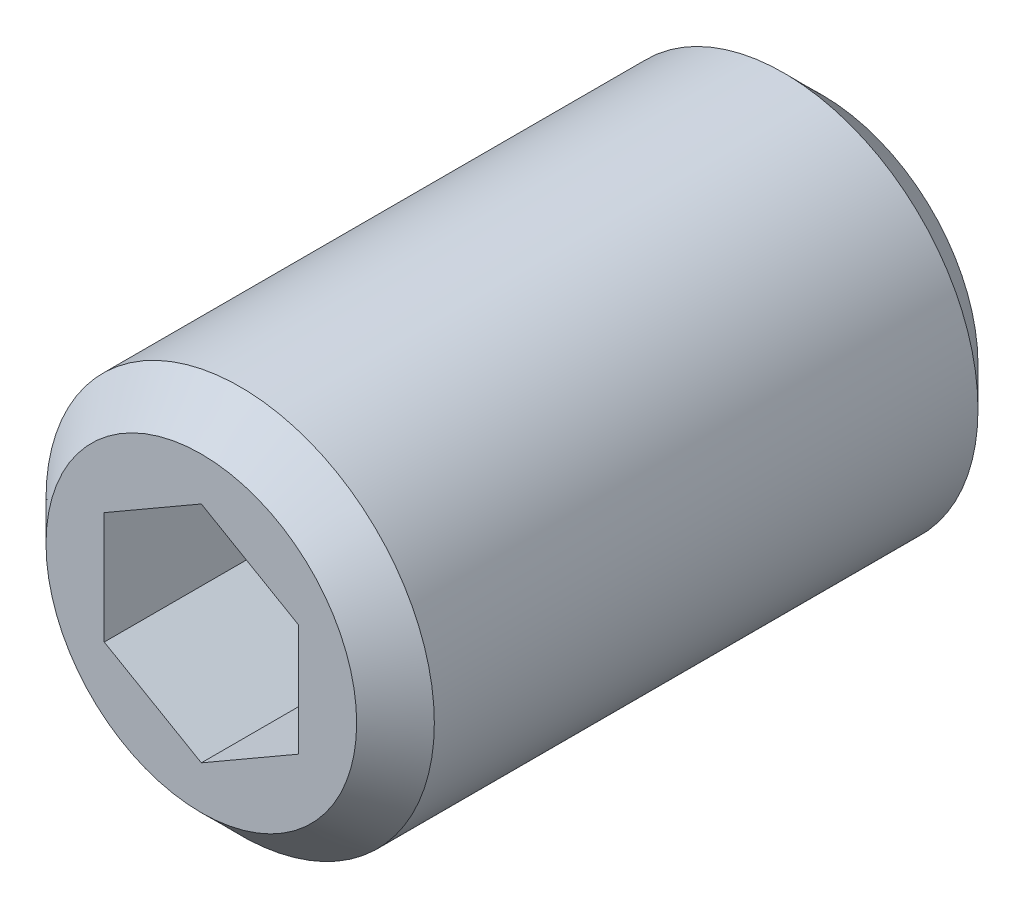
ISO-10303-21;
HEADER;
FILE_DESCRIPTION(('STEP AP214'),'2;1');
FILE_NAME('part.step','',(''),(''),'','','');
FILE_SCHEMA(('AUTOMOTIVE_DESIGN { 1 0 10303 214 1 1 1 1 }'));
ENDSEC;
DATA;
#1=APPLICATION_CONTEXT('core data for automotive mechanical design processes');
#2=APPLICATION_PROTOCOL_DEFINITION('international standard','automotive_design',2000,#1);
#3=PRODUCT_CONTEXT('',#1,'mechanical');
#4=PRODUCT('Part','Part','',(#3));
#5=PRODUCT_RELATED_PRODUCT_CATEGORY('part','',(#4));
#6=PRODUCT_DEFINITION_FORMATION('','',#4);
#7=PRODUCT_DEFINITION_CONTEXT('part definition',#1,'design');
#8=PRODUCT_DEFINITION('design','',#6,#7);
#9=PRODUCT_DEFINITION_SHAPE('','',#8);
#10=(LENGTH_UNIT() NAMED_UNIT(*) SI_UNIT(.MILLI.,.METRE.));
#11=(NAMED_UNIT(*) PLANE_ANGLE_UNIT() SI_UNIT($,.RADIAN.));
#12=(NAMED_UNIT(*) SI_UNIT($,.STERADIAN.) SOLID_ANGLE_UNIT());
#13=UNCERTAINTY_MEASURE_WITH_UNIT(LENGTH_MEASURE(1.E-05),#10,'distance_accuracy_value','');
#14=(GEOMETRIC_REPRESENTATION_CONTEXT(3) GLOBAL_UNCERTAINTY_ASSIGNED_CONTEXT((#13)) GLOBAL_UNIT_ASSIGNED_CONTEXT((#10,
#11,#12)) REPRESENTATION_CONTEXT('',''));
#15=CARTESIAN_POINT('',(0.,0.,0.));
#16=DIRECTION('',(0.,0.,1.));
#17=DIRECTION('',(1.,0.,0.));
#18=AXIS2_PLACEMENT_3D('',#15,#16,#17);
#19=CARTESIAN_POINT('',(0.,1.44337567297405,6.));
#20=DIRECTION('',(-0.5,-0.866025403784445,0.));
#21=DIRECTION('',(0.866025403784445,-0.5,0.));
#22=AXIS2_PLACEMENT_3D('',#19,#20,#21);
#23=PLANE('',#22);
#24=DIRECTION('',(0.,0.,1.));
#25=VECTOR('',#24,1.);
#26=CARTESIAN_POINT('',(1.25000000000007,0.721687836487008,6.));
#27=LINE('',#26,#25);
#28=CARTESIAN_POINT('',(1.25000000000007,0.721687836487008,6.));
#29=VERTEX_POINT('',#28);
#30=CARTESIAN_POINT('',(1.25000000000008,0.721687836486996,8.));
#31=VERTEX_POINT('',#30);
#32=EDGE_CURVE('E63',#29,#31,#27,.T.);
#33=ORIENTED_EDGE('',*,*,#32,.T.);
#34=DIRECTION('',(0.866025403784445,-0.5,0.));
#35=VECTOR('',#34,1.);
#36=CARTESIAN_POINT('',(0.,1.44337567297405,8.));
#37=LINE('',#36,#35);
#38=CARTESIAN_POINT('',(0.,1.44337567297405,8.));
#39=VERTEX_POINT('',#38);
#40=EDGE_CURVE('E29',#39,#31,#37,.T.);
#41=ORIENTED_EDGE('',*,*,#40,.F.);
#42=DIRECTION('',(0.,0.,1.));
#43=VECTOR('',#42,1.);
#44=CARTESIAN_POINT('',(0.,1.44337567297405,6.));
#45=LINE('',#44,#43);
#46=CARTESIAN_POINT('',(0.,1.44337567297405,6.));
#47=VERTEX_POINT('',#46);
#48=EDGE_CURVE('E33',#47,#39,#45,.T.);
#49=ORIENTED_EDGE('',*,*,#48,.F.);
#50=DIRECTION('',(0.866025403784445,-0.5,0.));
#51=VECTOR('',#50,1.);
#52=CARTESIAN_POINT('',(0.,1.44337567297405,6.));
#53=LINE('',#52,#51);
#54=EDGE_CURVE('E65',#47,#29,#53,.T.);
#55=ORIENTED_EDGE('',*,*,#54,.T.);
#56=EDGE_LOOP('',(#33,#41,#49,#55));
#57=FACE_BOUND('',#56,.T.);
#58=ADVANCED_FACE('F14',(#57),#23,.T.);
#59=CARTESIAN_POINT('',(1.25000000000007,0.721687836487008,6.));
#60=DIRECTION('',(-1.,0.,0.));
#61=DIRECTION('',(0.,-1.,0.));
#62=AXIS2_PLACEMENT_3D('',#59,#60,#61);
#63=PLANE('',#62);
#64=DIRECTION('',(0.,0.,1.));
#65=VECTOR('',#64,1.);
#66=CARTESIAN_POINT('',(1.25000000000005,-0.721687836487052,6.));
#67=LINE('',#66,#65);
#68=CARTESIAN_POINT('',(1.25000000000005,-0.721687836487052,6.));
#69=VERTEX_POINT('',#68);
#70=CARTESIAN_POINT('',(1.25000000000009,-0.721687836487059,8.));
#71=VERTEX_POINT('',#70);
#72=EDGE_CURVE('E70',#69,#71,#67,.T.);
#73=ORIENTED_EDGE('',*,*,#72,.T.);
#74=DIRECTION('',(0.,-1.,0.));
#75=VECTOR('',#74,1.);
#76=CARTESIAN_POINT('',(1.25000000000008,0.721687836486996,8.));
#77=LINE('',#76,#75);
#78=EDGE_CURVE('E73',#31,#71,#77,.T.);
#79=ORIENTED_EDGE('',*,*,#78,.F.);
#80=ORIENTED_EDGE('',*,*,#32,.F.);
#81=DIRECTION('',(0.,-1.,0.));
#82=VECTOR('',#81,1.);
#83=CARTESIAN_POINT('',(1.25000000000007,0.721687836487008,6.));
#84=LINE('',#83,#82);
#85=EDGE_CURVE('E100',#29,#69,#84,.T.);
#86=ORIENTED_EDGE('',*,*,#85,.T.);
#87=EDGE_LOOP('',(#73,#79,#80,#86));
#88=FACE_BOUND('',#87,.T.);
#89=ADVANCED_FACE('F74',(#88),#63,.T.);
#90=CARTESIAN_POINT('',(0.,-1.44337567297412,6.));
#91=DIRECTION('',(0.5,-0.866025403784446,0.));
#92=DIRECTION('',(0.866025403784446,0.5,0.));
#93=AXIS2_PLACEMENT_3D('',#90,#91,#92);
#94=PLANE('',#93);
#95=DIRECTION('',(0.,0.,1.));
#96=VECTOR('',#95,1.);
#97=CARTESIAN_POINT('',(0.,-1.44337567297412,6.));
#98=LINE('',#97,#96);
#99=CARTESIAN_POINT('',(0.,-1.44337567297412,6.));
#100=VERTEX_POINT('',#99);
#101=CARTESIAN_POINT('',(0.,-1.44337567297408,8.));
#102=VERTEX_POINT('',#101);
#103=EDGE_CURVE('E108',#100,#102,#98,.T.);
#104=ORIENTED_EDGE('',*,*,#103,.T.);
#105=DIRECTION('',(0.866025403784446,0.5,0.));
#106=VECTOR('',#105,1.);
#107=CARTESIAN_POINT('',(0.,-1.44337567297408,8.));
#108=LINE('',#107,#106);
#109=EDGE_CURVE('E78',#102,#71,#108,.T.);
#110=ORIENTED_EDGE('',*,*,#109,.T.);
#111=ORIENTED_EDGE('',*,*,#72,.F.);
#112=DIRECTION('',(0.866025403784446,0.5,0.));
#113=VECTOR('',#112,1.);
#114=CARTESIAN_POINT('',(0.,-1.44337567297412,6.));
#115=LINE('',#114,#113);
#116=EDGE_CURVE('E97',#100,#69,#115,.T.);
#117=ORIENTED_EDGE('',*,*,#116,.F.);
#118=EDGE_LOOP('',(#104,#110,#111,#117));
#119=FACE_BOUND('',#118,.T.);
#120=ADVANCED_FACE('F140',(#119),#94,.F.);
#121=CARTESIAN_POINT('',(0.,-1.44337567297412,6.));
#122=DIRECTION('',(0.5,0.86602540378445,0.));
#123=DIRECTION('',(-0.86602540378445,0.5,0.));
#124=AXIS2_PLACEMENT_3D('',#121,#122,#123);
#125=PLANE('',#124);
#126=DIRECTION('',(0.,0.,1.));
#127=VECTOR('',#126,1.);
#128=CARTESIAN_POINT('',(-1.24999999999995,-0.721687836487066,6.));
#129=LINE('',#128,#127);
#130=CARTESIAN_POINT('',(-1.24999999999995,-0.721687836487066,6.));
#131=VERTEX_POINT('',#130);
#132=CARTESIAN_POINT('',(-1.24999999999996,-0.721687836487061,8.));
#133=VERTEX_POINT('',#132);
#134=EDGE_CURVE('E106',#131,#133,#129,.T.);
#135=ORIENTED_EDGE('',*,*,#134,.T.);
#136=DIRECTION('',(-0.86602540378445,0.5,0.));
#137=VECTOR('',#136,1.);
#138=CARTESIAN_POINT('',(0.,-1.44337567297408,8.));
#139=LINE('',#138,#137);
#140=EDGE_CURVE('E250',#102,#133,#139,.T.);
#141=ORIENTED_EDGE('',*,*,#140,.F.);
#142=ORIENTED_EDGE('',*,*,#103,.F.);
#143=DIRECTION('',(-0.86602540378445,0.5,0.));
#144=VECTOR('',#143,1.);
#145=CARTESIAN_POINT('',(0.,-1.44337567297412,6.));
#146=LINE('',#145,#144);
#147=EDGE_CURVE('E94',#100,#131,#146,.T.);
#148=ORIENTED_EDGE('',*,*,#147,.T.);
#149=EDGE_LOOP('',(#135,#141,#142,#148));
#150=FACE_BOUND('',#149,.T.);
#151=ADVANCED_FACE('F151',(#150),#125,.T.);
#152=CARTESIAN_POINT('',(-1.24999999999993,0.721687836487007,6.));
#153=DIRECTION('',(-1.,0.,0.));
#154=DIRECTION('',(0.,0.,1.));
#155=AXIS2_PLACEMENT_3D('',#152,#153,#154);
#156=PLANE('',#155);
#157=DIRECTION('',(0.,0.,1.));
#158=VECTOR('',#157,1.);
#159=CARTESIAN_POINT('',(-1.24999999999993,0.721687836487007,6.));
#160=LINE('',#159,#158);
#161=CARTESIAN_POINT('',(-1.24999999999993,0.721687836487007,6.));
#162=VERTEX_POINT('',#161);
#163=CARTESIAN_POINT('',(-1.24999999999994,0.721687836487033,8.));
#164=VERTEX_POINT('',#163);
#165=EDGE_CURVE('E104',#162,#164,#160,.T.);
#166=ORIENTED_EDGE('',*,*,#165,.T.);
#167=DIRECTION('',(0.,-1.,0.));
#168=VECTOR('',#167,1.);
#169=CARTESIAN_POINT('',(-1.24999999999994,0.721687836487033,8.));
#170=LINE('',#169,#168);
#171=EDGE_CURVE('E251',#164,#133,#170,.T.);
#172=ORIENTED_EDGE('',*,*,#171,.T.);
#173=ORIENTED_EDGE('',*,*,#134,.F.);
#174=DIRECTION('',(0.,-1.,0.));
#175=VECTOR('',#174,1.);
#176=CARTESIAN_POINT('',(-1.24999999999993,0.721687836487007,6.));
#177=LINE('',#176,#175);
#178=EDGE_CURVE('E91',#162,#131,#177,.T.);
#179=ORIENTED_EDGE('',*,*,#178,.F.);
#180=EDGE_LOOP('',(#166,#172,#173,#179));
#181=FACE_BOUND('',#180,.T.);
#182=ADVANCED_FACE('F147',(#181),#156,.F.);
#183=CARTESIAN_POINT('',(0.,1.44337567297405,6.));
#184=DIRECTION('',(-0.5,0.86602540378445,0.));
#185=DIRECTION('',(-0.86602540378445,-0.5,0.));
#186=AXIS2_PLACEMENT_3D('',#183,#184,#185);
#187=PLANE('',#186);
#188=DIRECTION('',(-0.86602540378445,-0.5,0.));
#189=VECTOR('',#188,1.);
#190=CARTESIAN_POINT('',(0.,1.44337567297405,6.));
#191=LINE('',#190,#189);
#192=EDGE_CURVE('E88',#47,#162,#191,.T.);
#193=ORIENTED_EDGE('',*,*,#192,.F.);
#194=ORIENTED_EDGE('',*,*,#48,.T.);
#195=DIRECTION('',(-0.86602540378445,-0.5,0.));
#196=VECTOR('',#195,1.);
#197=CARTESIAN_POINT('',(0.,1.44337567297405,8.));
#198=LINE('',#197,#196);
#199=EDGE_CURVE('E84',#39,#164,#198,.T.);
#200=ORIENTED_EDGE('',*,*,#199,.T.);
#201=ORIENTED_EDGE('',*,*,#165,.F.);
#202=EDGE_LOOP('',(#193,#194,#200,#201));
#203=FACE_BOUND('',#202,.T.);
#204=ADVANCED_FACE('F144',(#203),#187,.F.);
#205=CARTESIAN_POINT('',(2.50000000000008,0.,6.));
#206=DIRECTION('',(0.,0.,1.));
#207=DIRECTION('',(1.,0.,0.));
#208=AXIS2_PLACEMENT_3D('',#205,#206,#207);
#209=PLANE('',#208);
#210=ORIENTED_EDGE('',*,*,#54,.F.);
#211=ORIENTED_EDGE('',*,*,#192,.T.);
#212=ORIENTED_EDGE('',*,*,#178,.T.);
#213=ORIENTED_EDGE('',*,*,#147,.F.);
#214=ORIENTED_EDGE('',*,*,#116,.T.);
#215=ORIENTED_EDGE('',*,*,#85,.F.);
#216=EDGE_LOOP('',(#210,#211,#212,#213,#214,#215));
#217=FACE_BOUND('',#216,.T.);
#218=ADVANCED_FACE('F143',(#217),#209,.T.);
#219=CARTESIAN_POINT('',(2.5000000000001,0.,8.));
#220=DIRECTION('',(0.,0.,-1.));
#221=DIRECTION('',(-1.,0.,0.));
#222=AXIS2_PLACEMENT_3D('',#219,#220,#221);
#223=PLANE('',#222);
#224=CARTESIAN_POINT('',(0.,0.,8.));
#225=DIRECTION('',(0.,0.,-1.));
#226=DIRECTION('',(-1.,0.,0.));
#227=AXIS2_PLACEMENT_3D('',#224,#225,#226);
#228=CIRCLE('',#227,2.);
#229=CARTESIAN_POINT('',(-1.99999999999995,0.,8.));
#230=VERTEX_POINT('',#229);
#231=EDGE_CURVE('E22',#230,#230,#228,.F.);
#232=ORIENTED_EDGE('',*,*,#231,.T.);
#233=EDGE_LOOP('',(#232));
#234=FACE_BOUND('',#233,.T.);
#235=ORIENTED_EDGE('',*,*,#40,.T.);
#236=ORIENTED_EDGE('',*,*,#78,.T.);
#237=ORIENTED_EDGE('',*,*,#109,.F.);
#238=ORIENTED_EDGE('',*,*,#140,.T.);
#239=ORIENTED_EDGE('',*,*,#171,.F.);
#240=ORIENTED_EDGE('',*,*,#199,.F.);
#241=EDGE_LOOP('',(#235,#236,#237,#238,#239,#240));
#242=FACE_BOUND('',#241,.T.);
#243=ADVANCED_FACE('F81',(#234,#242),#223,.F.);
#244=CARTESIAN_POINT('',(0.,0.,0.));
#245=DIRECTION('',(0.,0.,1.));
#246=DIRECTION('',(1.,0.,0.));
#247=AXIS2_PLACEMENT_3D('',#244,#245,#246);
#248=PLANE('',#247);
#249=CARTESIAN_POINT('',(0.,0.,0.));
#250=DIRECTION('',(0.,0.,1.));
#251=DIRECTION('',(1.,0.,0.));
#252=AXIS2_PLACEMENT_3D('',#249,#250,#251);
#253=CIRCLE('',#252,2.);
#254=CARTESIAN_POINT('',(2.,0.,0.));
#255=VERTEX_POINT('',#254);
#256=EDGE_CURVE('E113',#255,#255,#253,.T.);
#257=ORIENTED_EDGE('',*,*,#256,.F.);
#258=EDGE_LOOP('',(#257));
#259=FACE_BOUND('',#258,.T.);
#260=ADVANCED_FACE('F16',(#259),#248,.F.);
#261=CARTESIAN_POINT('',(0.,0.,0.5));
#262=DIRECTION('',(0.,0.,1.));
#263=DIRECTION('',(1.,0.,0.));
#264=AXIS2_PLACEMENT_3D('',#261,#262,#263);
#265=CONICAL_SURFACE('',#264,2.5,0.785398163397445);
#266=ORIENTED_EDGE('',*,*,#256,.T.);
#267=EDGE_LOOP('',(#266));
#268=FACE_BOUND('',#267,.T.);
#269=CARTESIAN_POINT('',(0.,0.,0.5));
#270=DIRECTION('',(0.,0.,1.));
#271=DIRECTION('',(1.,0.,0.));
#272=AXIS2_PLACEMENT_3D('',#269,#270,#271);
#273=CIRCLE('',#272,2.5);
#274=CARTESIAN_POINT('',(2.5,0.,0.5));
#275=VERTEX_POINT('',#274);
#276=EDGE_CURVE('E69',#275,#275,#273,.T.);
#277=ORIENTED_EDGE('',*,*,#276,.F.);
#278=EDGE_LOOP('',(#277));
#279=FACE_BOUND('',#278,.T.);
#280=ADVANCED_FACE('F129',(#268,#279),#265,.T.);
#281=CARTESIAN_POINT('',(0.,0.,20.));
#282=DIRECTION('',(0.,0.,1.));
#283=DIRECTION('',(1.,0.,0.));
#284=AXIS2_PLACEMENT_3D('',#281,#282,#283);
#285=CYLINDRICAL_SURFACE('',#284,2.5);
#286=CARTESIAN_POINT('',(0.,0.,7.5));
#287=DIRECTION('',(0.,0.,-1.));
#288=DIRECTION('',(-1.,0.,0.));
#289=AXIS2_PLACEMENT_3D('',#286,#287,#288);
#290=CIRCLE('',#289,2.5);
#291=CARTESIAN_POINT('',(-2.49999999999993,0.,7.5));
#292=VERTEX_POINT('',#291);
#293=EDGE_CURVE('E9',#292,#292,#290,.T.);
#294=ORIENTED_EDGE('',*,*,#293,.T.);
#295=EDGE_LOOP('',(#294));
#296=FACE_BOUND('',#295,.T.);
#297=ORIENTED_EDGE('',*,*,#276,.T.);
#298=EDGE_LOOP('',(#297));
#299=FACE_BOUND('',#298,.T.);
#300=ADVANCED_FACE('F121',(#296,#299),#285,.T.);
#301=CARTESIAN_POINT('',(0.,0.,8.));
#302=DIRECTION('',(0.,0.,-1.));
#303=DIRECTION('',(-1.,0.,0.));
#304=AXIS2_PLACEMENT_3D('',#301,#302,#303);
#305=CONICAL_SURFACE('',#304,2.,0.785398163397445);
#306=ORIENTED_EDGE('',*,*,#293,.F.);
#307=EDGE_LOOP('',(#306));
#308=FACE_BOUND('',#307,.T.);
#309=ORIENTED_EDGE('',*,*,#231,.F.);
#310=EDGE_LOOP('',(#309));
#311=FACE_BOUND('',#310,.T.);
#312=ADVANCED_FACE('F119',(#308,#311),#305,.T.);
#313=CLOSED_SHELL('',(#58,#89,#120,#151,#182,#204,#218,#243,#260,#280,#300,#312));
#314=MANIFOLD_SOLID_BREP('B1',#313);
#315=ADVANCED_BREP_SHAPE_REPRESENTATION('',(#18,#314),#14);
#316=SHAPE_DEFINITION_REPRESENTATION(#9,#315);
ENDSEC;
END-ISO-10303-21;
